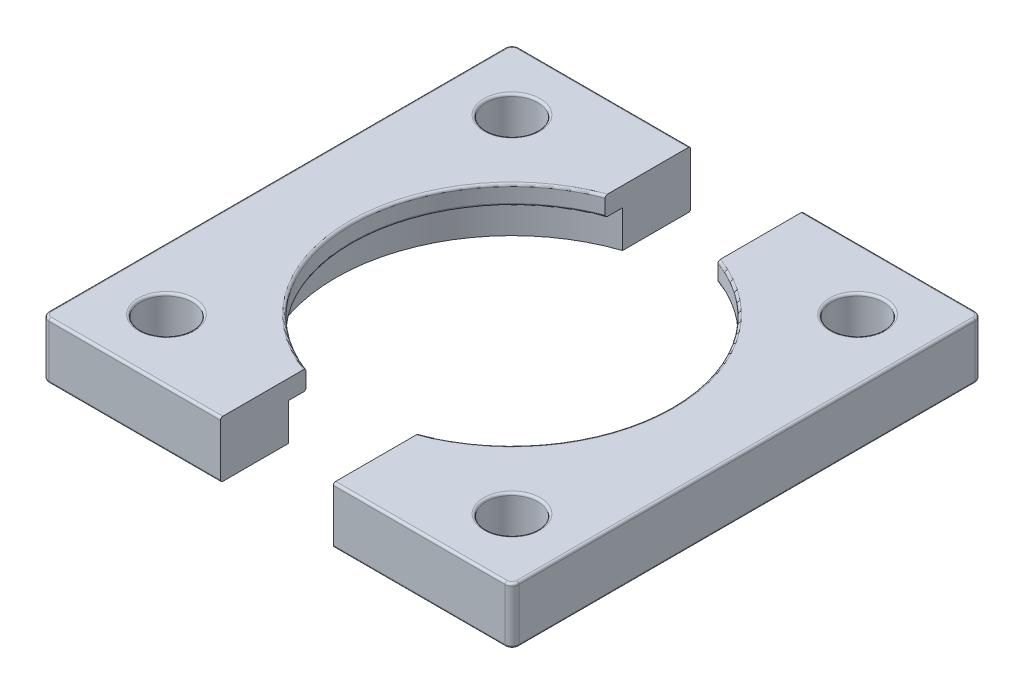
from build123d import *

# Parameters (mm, degrees)
SKETCH1_R             = 5.5
BOSS_EXTRUDE1_DEPTH   = 12
BOSS_EXTRUDE1_2_DEPTH = 12
SKETCH2_R             = 37.5
CUT_EXTRUDE1_DEPTH    = 7.9
FILLET1_R             = 0.5
FILLET2_R             = 0.5


with BuildPart() as part:
    # Sketch1 → Boss-Extrude1 (new body)
    with BuildSketch(Plane(origin=(0, 0, 0), x_dir=(1, 0, 0), z_dir=(0, 1, 0))):
        with BuildLine():
            Line((12, 50), (12, 31.811947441))
            ThreePointArc((12, 31.811947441), (34, 0), (12, -31.811947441))
            Line((12, -31.811947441), (12, -50))
            Line((12, -50), (48.5, -50))
            ThreePointArc((48.5, -50), (49.560660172, -49.560660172), (50, -48.5))
            Line((50, -48.5), (50, 48.5))
            ThreePointArc((50, 48.5), (49.560660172, 49.560660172), (48.5, 50))
            Line((48.5, 50), (12, 50))
        make_face()
        with Locations(Location((36.75, 36.75, 0), (0, 0, 90))):
            Circle(SKETCH1_R, mode=Mode.SUBTRACT)
        with Locations(Location((36.75, -36.75, 0), (0, 0, 270))):
            Circle(SKETCH1_R, mode=Mode.SUBTRACT)
    extrude(amount=BOSS_EXTRUDE1_DEPTH)


with BuildPart() as body_2:
    # Sketch1 → Boss-Extrude1 2 (new body)
    with BuildSketch(Plane(origin=(0, 0, 0), x_dir=(1, 0, 0), z_dir=(0, 1, 0))):
        with BuildLine():
            Line((-48.5, 50), (-12, 50))
            Line((-12, 50), (-12, 31.811947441))
            ThreePointArc((-12, 31.811947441), (-34, 0), (-12, -31.811947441))
            Line((-12, -31.811947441), (-12, -50))
            Line((-12, -50), (-48.5, -50))
            ThreePointArc((-48.5, -50), (-49.560660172, -49.560660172), (-50, -48.5))
            Line((-50, -48.5), (-50, 48.5))
            ThreePointArc((-50, 48.5), (-49.560660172, 49.560660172), (-48.5, 50))
        make_face()
        with Locations(Location((-36.75, 36.75, 0), (0, 0, 270))):
            Circle(SKETCH1_R, mode=Mode.SUBTRACT)
        with Locations(Location((-36.75, -36.75, 0), (0, 0, 90))):
            Circle(SKETCH1_R, mode=Mode.SUBTRACT)
    extrude(amount=BOSS_EXTRUDE1_2_DEPTH)


with BuildPart() as cut_extrude1_tool:
    # Sketch2 → Cut-Extrude1 (new body)
    with BuildSketch(Plane.XZ):
        Circle(SKETCH2_R)
    extrude(amount=-CUT_EXTRUDE1_DEPTH)


with BuildPart() as part_1:
    add(part.part)

    # Cut-Extrude1: cut by cut_extrude1_tool
    add(cut_extrude1_tool.part, mode=Mode.SUBTRACT)

    # Fillet2
    fillet2_edges = [part_1.edges().sort_by_distance(p)[0] for p in [
        (30.25, 12, 50),
        (49.560660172, 12, 49.560660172),
        (50, 12, 0),
        (49.560660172, 12, -49.560660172),
        (36.75, 12, -31.25),
        (30.25, 12, -50),
        (36.75, 12, 31.25),
        (34, 7.9, 0),
        (34, 12, 0),
        (30.25, 0, -50),
        (49.560660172, 0, -49.560660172),
        (50, 0, 0),
        (49.560660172, 0, 49.560660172),
        (30.25, 0, 50),
    ]]
    fillet(fillet2_edges, radius=FILLET2_R)


with BuildPart() as body_2_1:
    add(body_2.part)

    # Cut-Extrude1: cut by cut_extrude1_tool
    add(cut_extrude1_tool.part, mode=Mode.SUBTRACT)

    # Fillet1
    fillet1_edges = [body_2_1.edges().sort_by_distance(p)[0] for p in [
        (-30.25, 0, 50),
        (-49.560660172, 0, 49.560660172),
        (-34, 12, 0),
        (-30.25, 12, -50),
        (-36.75, 12, -42.25),
        (-49.560660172, 12, -49.560660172),
        (-36.75, 12, 42.25),
        (-50, 12, 0),
        (-34, 7.9, 0),
        (-49.560660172, 12, 49.560660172),
        (-30.25, 12, 50),
        (-50, 0, 0),
        (-49.560660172, 0, -49.560660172),
        (-30.25, 0, -50),
    ]]
    fillet(fillet1_edges, radius=FILLET1_R)


solid = Compound([part_1.part, body_2_1.part])
